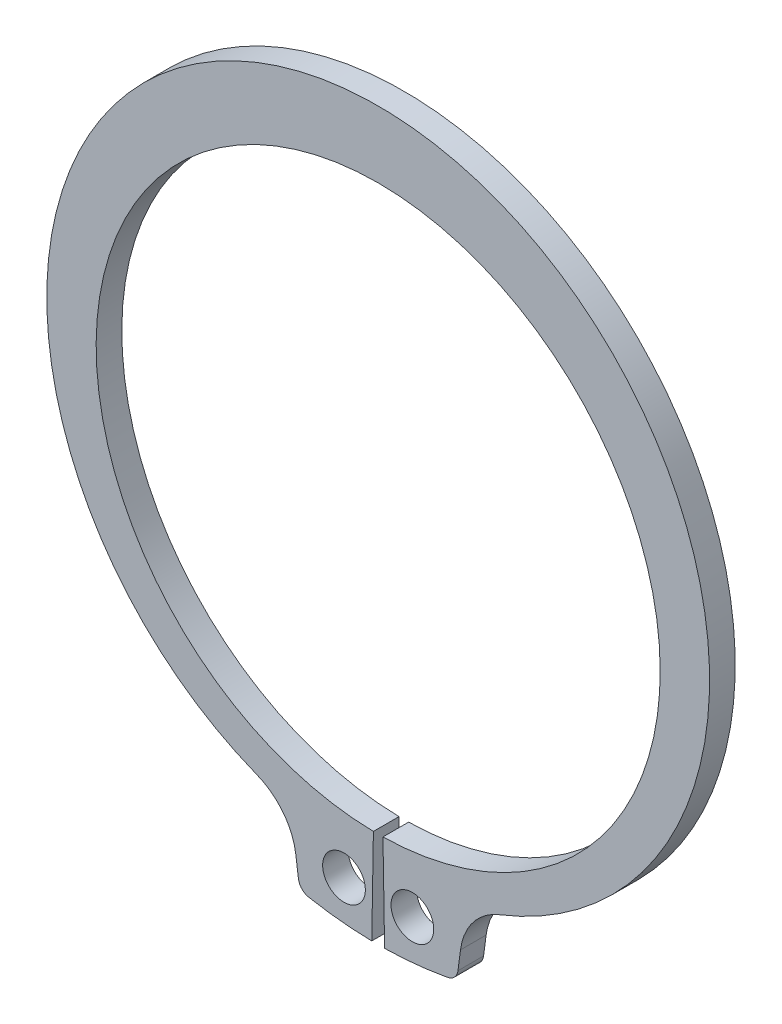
from build123d import *

# Parameters (mm, degrees)
BODYSKE_R  = 1.25
BODY_DEPTH = 1.5


with BuildPart() as part:
    # BodySke → Body (new body)
    with BuildSketch(Plane.XY):
        with BuildLine():
            Line((0.279977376, -16.497624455), (0.375, -22.09681821))
            ThreePointArc((0.375, -22.09681821), (2.225867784, -21.987621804), (4.061068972, -21.72366725))
            ThreePointArc((4.061068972, -21.72366725), (4.46768046, -21.502283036), (4.666833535, -21.084333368))
            Line((4.666833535, -21.084333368), (4.816047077, -19.950943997))
            ThreePointArc((4.816047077, -19.950943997), (5.558942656, -18.179874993), (7.098176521, -17.031250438))
            ThreePointArc((7.098176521, -17.031250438), (0, 20.4), (-7.098176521, -17.031250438))
            ThreePointArc((-7.098176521, -17.031250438), (-5.558942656, -18.179874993), (-4.816047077, -19.950943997))
            Line((-4.816047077, -19.950943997), (-4.666833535, -21.084333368))
            ThreePointArc((-4.666833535, -21.084333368), (-4.46768046, -21.502283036), (-4.061068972, -21.72366725))
            ThreePointArc((-4.061068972, -21.72366725), (-2.225867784, -21.987621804), (-0.375, -22.09681821))
            Line((-0.375, -22.09681821), (-0.279977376, -16.497624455))
            ThreePointArc((-0.279977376, -16.497624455), (0, 16.5), (0.279977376, -16.497624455))
        make_face()
        with Locations((2, -19.698730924)):
            Circle(BODYSKE_R, mode=Mode.SUBTRACT)
        with Locations((-2, -19.698730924)):
            Circle(BODYSKE_R, mode=Mode.SUBTRACT)
    extrude(amount=-BODY_DEPTH)


solid = part.part
